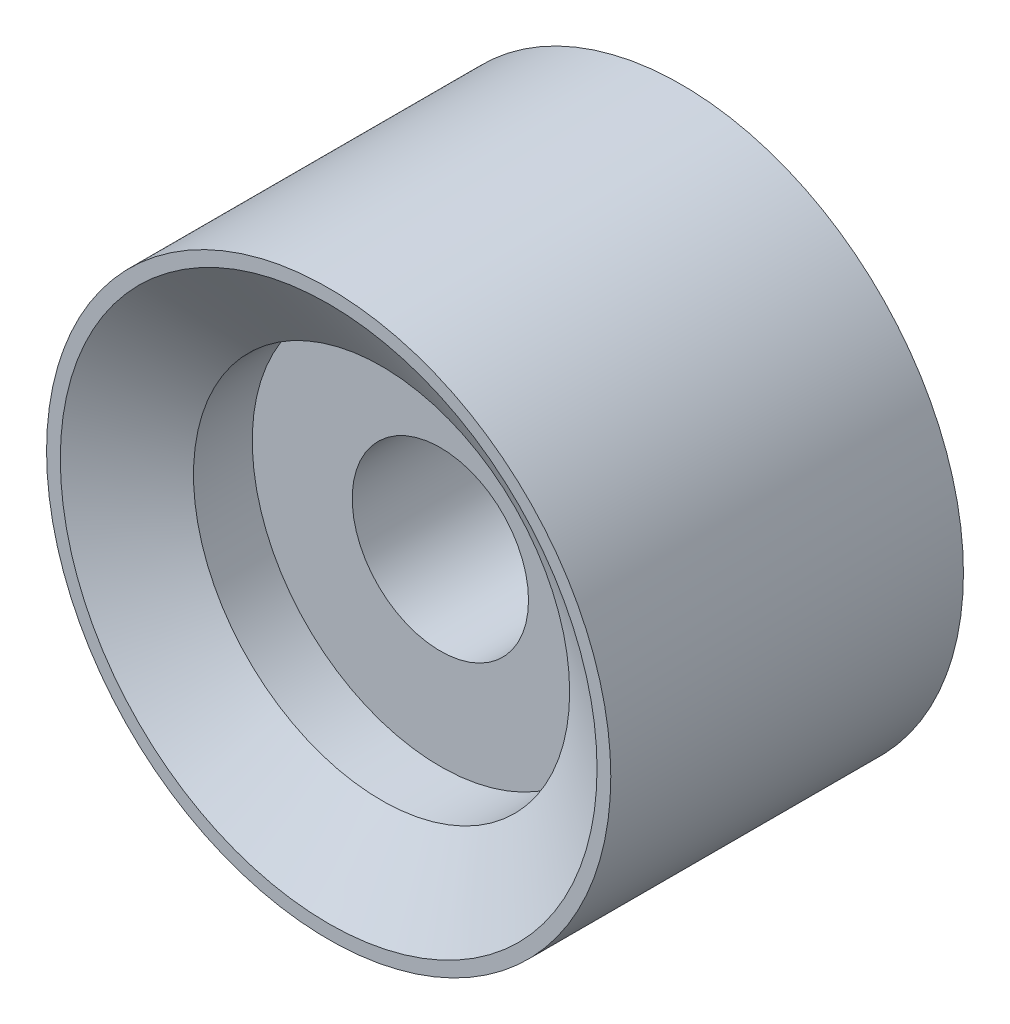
ISO-10303-21;
HEADER;
FILE_DESCRIPTION(('STEP AP214'),'2;1');
FILE_NAME('part.step','',(''),(''),'','','');
FILE_SCHEMA(('AUTOMOTIVE_DESIGN { 1 0 10303 214 1 1 1 1 }'));
ENDSEC;
DATA;
#1=APPLICATION_CONTEXT('core data for automotive mechanical design processes');
#2=APPLICATION_PROTOCOL_DEFINITION('international standard','automotive_design',2000,#1);
#3=PRODUCT_CONTEXT('',#1,'mechanical');
#4=PRODUCT('Part','Part','',(#3));
#5=PRODUCT_RELATED_PRODUCT_CATEGORY('part','',(#4));
#6=PRODUCT_DEFINITION_FORMATION('','',#4);
#7=PRODUCT_DEFINITION_CONTEXT('part definition',#1,'design');
#8=PRODUCT_DEFINITION('design','',#6,#7);
#9=PRODUCT_DEFINITION_SHAPE('','',#8);
#10=(LENGTH_UNIT() NAMED_UNIT(*) SI_UNIT(.MILLI.,.METRE.));
#11=(NAMED_UNIT(*) PLANE_ANGLE_UNIT() SI_UNIT($,.RADIAN.));
#12=(NAMED_UNIT(*) SI_UNIT($,.STERADIAN.) SOLID_ANGLE_UNIT());
#13=UNCERTAINTY_MEASURE_WITH_UNIT(LENGTH_MEASURE(1.E-05),#10,'distance_accuracy_value','');
#14=(GEOMETRIC_REPRESENTATION_CONTEXT(3) GLOBAL_UNCERTAINTY_ASSIGNED_CONTEXT((#13)) GLOBAL_UNIT_ASSIGNED_CONTEXT((#10,
#11,#12)) REPRESENTATION_CONTEXT('',''));
#15=CARTESIAN_POINT('',(0.,0.,0.));
#16=DIRECTION('',(0.,0.,1.));
#17=DIRECTION('',(1.,0.,0.));
#18=AXIS2_PLACEMENT_3D('',#15,#16,#17);
#19=CARTESIAN_POINT('',(0.,22.8303571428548,-15.));
#20=DIRECTION('',(0.,0.,1.));
#21=DIRECTION('',(1.,0.,0.));
#22=AXIS2_PLACEMENT_3D('',#19,#20,#21);
#23=PLANE('',#22);
#24=CARTESIAN_POINT('',(0.,0.,-15.));
#25=DIRECTION('',(0.,0.,1.));
#26=DIRECTION('',(1.,0.,0.));
#27=AXIS2_PLACEMENT_3D('',#24,#25,#26);
#28=CIRCLE('',#27,22.8303571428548);
#29=CARTESIAN_POINT('',(22.8303571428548,0.,-15.));
#30=VERTEX_POINT('',#29);
#31=EDGE_CURVE('E27',#30,#30,#28,.T.);
#32=ORIENTED_EDGE('',*,*,#31,.T.);
#33=EDGE_LOOP('',(#32));
#34=FACE_BOUND('',#33,.T.);
#35=CARTESIAN_POINT('',(0.,0.,-15.));
#36=DIRECTION('',(0.,0.,1.));
#37=DIRECTION('',(1.,0.,0.));
#38=AXIS2_PLACEMENT_3D('',#35,#36,#37);
#39=CIRCLE('',#38,24.);
#40=CARTESIAN_POINT('',(24.,0.,-15.));
#41=VERTEX_POINT('',#40);
#42=EDGE_CURVE('E44',#41,#41,#39,.T.);
#43=ORIENTED_EDGE('',*,*,#42,.F.);
#44=EDGE_LOOP('',(#43));
#45=FACE_BOUND('',#44,.T.);
#46=ADVANCED_FACE('F12',(#34,#45),#23,.F.);
#47=CARTESIAN_POINT('',(0.,22.8303571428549,15.));
#48=DIRECTION('',(0.,0.,-1.));
#49=DIRECTION('',(-1.,0.,0.));
#50=AXIS2_PLACEMENT_3D('',#47,#48,#49);
#51=PLANE('',#50);
#52=CARTESIAN_POINT('',(0.,0.,15.));
#53=DIRECTION('',(0.,0.,1.));
#54=DIRECTION('',(1.,0.,0.));
#55=AXIS2_PLACEMENT_3D('',#52,#53,#54);
#56=CIRCLE('',#55,22.8303571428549);
#57=CARTESIAN_POINT('',(22.8303571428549,0.,15.));
#58=VERTEX_POINT('',#57);
#59=EDGE_CURVE('E32',#58,#58,#56,.T.);
#60=ORIENTED_EDGE('',*,*,#59,.F.);
#61=EDGE_LOOP('',(#60));
#62=FACE_BOUND('',#61,.T.);
#63=CARTESIAN_POINT('',(0.,0.,15.));
#64=DIRECTION('',(0.,0.,1.));
#65=DIRECTION('',(1.,0.,0.));
#66=AXIS2_PLACEMENT_3D('',#63,#64,#65);
#67=CIRCLE('',#66,24.);
#68=CARTESIAN_POINT('',(24.,0.,15.));
#69=VERTEX_POINT('',#68);
#70=EDGE_CURVE('E45',#69,#69,#67,.T.);
#71=ORIENTED_EDGE('',*,*,#70,.T.);
#72=EDGE_LOOP('',(#71));
#73=FACE_BOUND('',#72,.T.);
#74=ADVANCED_FACE('F55',(#62,#73),#51,.F.);
#75=CARTESIAN_POINT('',(0.,0.,19.75));
#76=DIRECTION('',(0.,0.,1.));
#77=DIRECTION('',(1.,0.,0.));
#78=AXIS2_PLACEMENT_3D('',#75,#76,#77);
#79=CYLINDRICAL_SURFACE('',#78,7.5000000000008);
#80=CARTESIAN_POINT('',(0.,0.,-5.5));
#81=DIRECTION('',(0.,0.,1.));
#82=DIRECTION('',(1.,0.,0.));
#83=AXIS2_PLACEMENT_3D('',#80,#81,#82);
#84=CIRCLE('',#83,7.5000000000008);
#85=CARTESIAN_POINT('',(7.5000000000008,0.,-5.5));
#86=VERTEX_POINT('',#85);
#87=EDGE_CURVE('E8',#86,#86,#84,.T.);
#88=ORIENTED_EDGE('',*,*,#87,.F.);
#89=EDGE_LOOP('',(#88));
#90=FACE_BOUND('',#89,.T.);
#91=CARTESIAN_POINT('',(0.,0.,5.5));
#92=DIRECTION('',(0.,0.,1.));
#93=DIRECTION('',(1.,0.,0.));
#94=AXIS2_PLACEMENT_3D('',#91,#92,#93);
#95=CIRCLE('',#94,7.5000000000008);
#96=CARTESIAN_POINT('',(7.5000000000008,0.,5.5));
#97=VERTEX_POINT('',#96);
#98=EDGE_CURVE('E41',#97,#97,#95,.T.);
#99=ORIENTED_EDGE('',*,*,#98,.T.);
#100=EDGE_LOOP('',(#99));
#101=FACE_BOUND('',#100,.T.);
#102=ADVANCED_FACE('F14',(#90,#101),#79,.F.);
#103=CARTESIAN_POINT('',(0.,7.5000000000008,-5.5));
#104=DIRECTION('',(0.,0.,1.));
#105=DIRECTION('',(1.,0.,0.));
#106=AXIS2_PLACEMENT_3D('',#103,#104,#105);
#107=PLANE('',#106);
#108=CARTESIAN_POINT('',(0.,0.,-5.5));
#109=DIRECTION('',(0.,0.,1.));
#110=DIRECTION('',(1.,0.,0.));
#111=AXIS2_PLACEMENT_3D('',#108,#109,#110);
#112=CIRCLE('',#111,16.);
#113=CARTESIAN_POINT('',(16.,0.,-5.5));
#114=VERTEX_POINT('',#113);
#115=EDGE_CURVE('E19',#114,#114,#112,.T.);
#116=ORIENTED_EDGE('',*,*,#115,.F.);
#117=EDGE_LOOP('',(#116));
#118=FACE_BOUND('',#117,.T.);
#119=ORIENTED_EDGE('',*,*,#87,.T.);
#120=EDGE_LOOP('',(#119));
#121=FACE_BOUND('',#120,.T.);
#122=ADVANCED_FACE('F74',(#118,#121),#107,.F.);
#123=CARTESIAN_POINT('',(0.,0.,19.75));
#124=DIRECTION('',(0.,0.,1.));
#125=DIRECTION('',(1.,0.,0.));
#126=AXIS2_PLACEMENT_3D('',#123,#124,#125);
#127=CYLINDRICAL_SURFACE('',#126,16.);
#128=CARTESIAN_POINT('',(0.,0.,-10.5));
#129=DIRECTION('',(0.,0.,1.));
#130=DIRECTION('',(1.,0.,0.));
#131=AXIS2_PLACEMENT_3D('',#128,#129,#130);
#132=CIRCLE('',#131,16.);
#133=CARTESIAN_POINT('',(16.,0.,-10.5));
#134=VERTEX_POINT('',#133);
#135=EDGE_CURVE('E23',#134,#134,#132,.T.);
#136=ORIENTED_EDGE('',*,*,#135,.F.);
#137=EDGE_LOOP('',(#136));
#138=FACE_BOUND('',#137,.T.);
#139=ORIENTED_EDGE('',*,*,#115,.T.);
#140=EDGE_LOOP('',(#139));
#141=FACE_BOUND('',#140,.T.);
#142=ADVANCED_FACE('F71',(#138,#141),#127,.F.);
#143=CARTESIAN_POINT('',(0.,0.,-10.5));
#144=DIRECTION('',(0.,0.,-1.));
#145=DIRECTION('',(-1.,0.,0.));
#146=AXIS2_PLACEMENT_3D('',#143,#144,#145);
#147=CONICAL_SURFACE('',#146,16.,0.988243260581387);
#148=ORIENTED_EDGE('',*,*,#31,.F.);
#149=EDGE_LOOP('',(#148));
#150=FACE_BOUND('',#149,.T.);
#151=ORIENTED_EDGE('',*,*,#135,.T.);
#152=EDGE_LOOP('',(#151));
#153=FACE_BOUND('',#152,.T.);
#154=ADVANCED_FACE('F67',(#150,#153),#147,.F.);
#155=CARTESIAN_POINT('',(0.,0.,15.));
#156=DIRECTION('',(0.,0.,1.));
#157=DIRECTION('',(1.,0.,0.));
#158=AXIS2_PLACEMENT_3D('',#155,#156,#157);
#159=CONICAL_SURFACE('',#158,22.8303571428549,0.988243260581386);
#160=CARTESIAN_POINT('',(0.,0.,10.5));
#161=DIRECTION('',(0.,0.,1.));
#162=DIRECTION('',(1.,0.,0.));
#163=AXIS2_PLACEMENT_3D('',#160,#161,#162);
#164=CIRCLE('',#163,16.);
#165=CARTESIAN_POINT('',(16.,0.,10.5));
#166=VERTEX_POINT('',#165);
#167=EDGE_CURVE('E35',#166,#166,#164,.T.);
#168=ORIENTED_EDGE('',*,*,#167,.F.);
#169=EDGE_LOOP('',(#168));
#170=FACE_BOUND('',#169,.T.);
#171=ORIENTED_EDGE('',*,*,#59,.T.);
#172=EDGE_LOOP('',(#171));
#173=FACE_BOUND('',#172,.T.);
#174=ADVANCED_FACE('F70',(#170,#173),#159,.F.);
#175=CARTESIAN_POINT('',(0.,0.,19.75));
#176=DIRECTION('',(0.,0.,1.));
#177=DIRECTION('',(1.,0.,0.));
#178=AXIS2_PLACEMENT_3D('',#175,#176,#177);
#179=CYLINDRICAL_SURFACE('',#178,16.);
#180=CARTESIAN_POINT('',(0.,0.,5.5));
#181=DIRECTION('',(0.,0.,1.));
#182=DIRECTION('',(1.,0.,0.));
#183=AXIS2_PLACEMENT_3D('',#180,#181,#182);
#184=CIRCLE('',#183,16.);
#185=CARTESIAN_POINT('',(16.,0.,5.5));
#186=VERTEX_POINT('',#185);
#187=EDGE_CURVE('E38',#186,#186,#184,.T.);
#188=ORIENTED_EDGE('',*,*,#187,.F.);
#189=EDGE_LOOP('',(#188));
#190=FACE_BOUND('',#189,.T.);
#191=ORIENTED_EDGE('',*,*,#167,.T.);
#192=EDGE_LOOP('',(#191));
#193=FACE_BOUND('',#192,.T.);
#194=ADVANCED_FACE('F92',(#190,#193),#179,.F.);
#195=CARTESIAN_POINT('',(0.,16.,5.5));
#196=DIRECTION('',(0.,0.,-1.));
#197=DIRECTION('',(-1.,0.,0.));
#198=AXIS2_PLACEMENT_3D('',#195,#196,#197);
#199=PLANE('',#198);
#200=ORIENTED_EDGE('',*,*,#98,.F.);
#201=EDGE_LOOP('',(#200));
#202=FACE_BOUND('',#201,.T.);
#203=ORIENTED_EDGE('',*,*,#187,.T.);
#204=EDGE_LOOP('',(#203));
#205=FACE_BOUND('',#204,.T.);
#206=ADVANCED_FACE('F89',(#202,#205),#199,.F.);
#207=CARTESIAN_POINT('',(0.,0.,-15.));
#208=DIRECTION('',(0.,0.,1.));
#209=DIRECTION('',(1.,0.,0.));
#210=AXIS2_PLACEMENT_3D('',#207,#208,#209);
#211=CYLINDRICAL_SURFACE('',#210,24.);
#212=ORIENTED_EDGE('',*,*,#42,.T.);
#213=EDGE_LOOP('',(#212));
#214=FACE_BOUND('',#213,.T.);
#215=ORIENTED_EDGE('',*,*,#70,.F.);
#216=EDGE_LOOP('',(#215));
#217=FACE_BOUND('',#216,.T.);
#218=ADVANCED_FACE('F51',(#214,#217),#211,.T.);
#219=CLOSED_SHELL('',(#46,#74,#102,#122,#142,#154,#174,#194,#206,#218));
#220=MANIFOLD_SOLID_BREP('B1',#219);
#221=ADVANCED_BREP_SHAPE_REPRESENTATION('',(#18,#220),#14);
#222=SHAPE_DEFINITION_REPRESENTATION(#9,#221);
ENDSEC;
END-ISO-10303-21;
